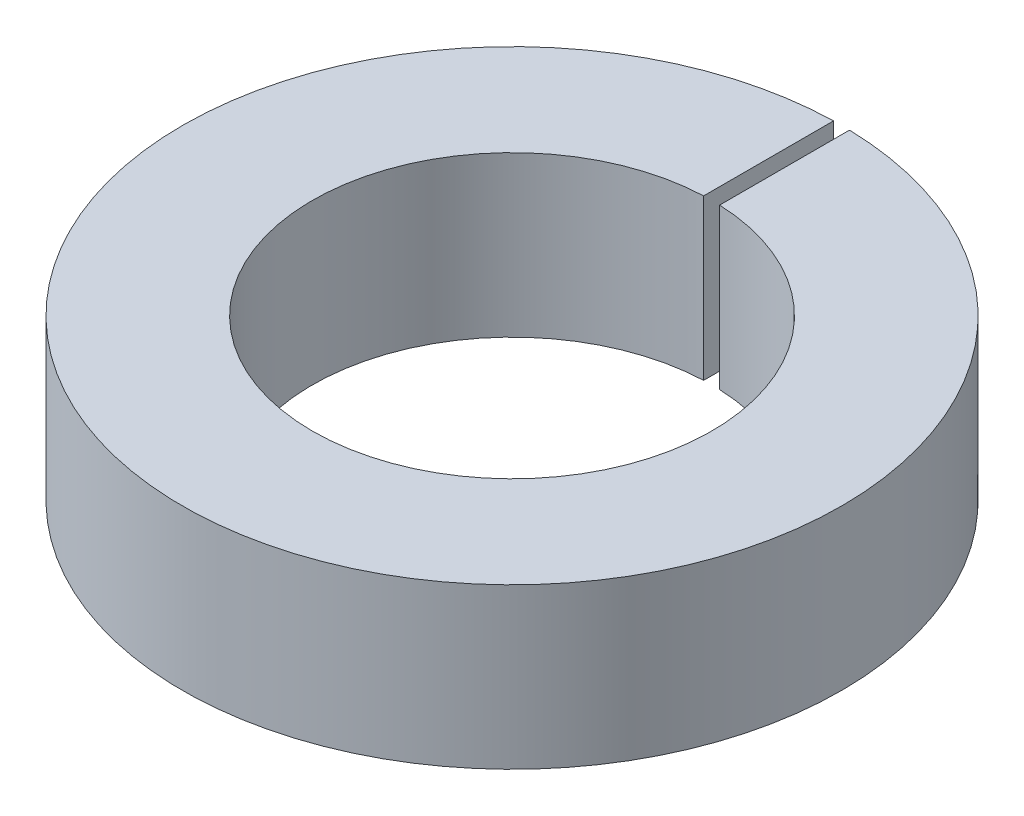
ISO-10303-21;
HEADER;
FILE_DESCRIPTION(('STEP AP214'),'2;1');
FILE_NAME('part.step','',(''),(''),'','','');
FILE_SCHEMA(('AUTOMOTIVE_DESIGN { 1 0 10303 214 1 1 1 1 }'));
ENDSEC;
DATA;
#1=APPLICATION_CONTEXT('core data for automotive mechanical design processes');
#2=APPLICATION_PROTOCOL_DEFINITION('international standard','automotive_design',2000,#1);
#3=PRODUCT_CONTEXT('',#1,'mechanical');
#4=PRODUCT('Part','Part','',(#3));
#5=PRODUCT_RELATED_PRODUCT_CATEGORY('part','',(#4));
#6=PRODUCT_DEFINITION_FORMATION('','',#4);
#7=PRODUCT_DEFINITION_CONTEXT('part definition',#1,'design');
#8=PRODUCT_DEFINITION('design','',#6,#7);
#9=PRODUCT_DEFINITION_SHAPE('','',#8);
#10=(LENGTH_UNIT() NAMED_UNIT(*) SI_UNIT(.MILLI.,.METRE.));
#11=(NAMED_UNIT(*) PLANE_ANGLE_UNIT() SI_UNIT($,.RADIAN.));
#12=(NAMED_UNIT(*) SI_UNIT($,.STERADIAN.) SOLID_ANGLE_UNIT());
#13=UNCERTAINTY_MEASURE_WITH_UNIT(LENGTH_MEASURE(1.E-05),#10,'distance_accuracy_value','');
#14=(GEOMETRIC_REPRESENTATION_CONTEXT(3) GLOBAL_UNCERTAINTY_ASSIGNED_CONTEXT((#13)) GLOBAL_UNIT_ASSIGNED_CONTEXT((#10,
#11,#12)) REPRESENTATION_CONTEXT('',''));
#15=CARTESIAN_POINT('',(0.,0.,0.));
#16=DIRECTION('',(0.,0.,1.));
#17=DIRECTION('',(1.,0.,0.));
#18=AXIS2_PLACEMENT_3D('',#15,#16,#17);
#19=CARTESIAN_POINT('',(0.,12.7,0.));
#20=DIRECTION('',(0.,1.,0.));
#21=DIRECTION('',(0.,0.,1.));
#22=AXIS2_PLACEMENT_3D('',#19,#20,#21);
#23=PLANE('',#22);
#24=DIRECTION('',(0.,0.,1.));
#25=VECTOR('',#24,1.);
#26=CARTESIAN_POINT('',(-0.635,12.7,-35.56));
#27=LINE('',#26,#25);
#28=CARTESIAN_POINT('',(-0.635,12.7,-26.1860518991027));
#29=VERTEX_POINT('',#28);
#30=CARTESIAN_POINT('',(-0.635,12.7,-15.8622949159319));
#31=VERTEX_POINT('',#30);
#32=EDGE_CURVE('E52',#29,#31,#27,.T.);
#33=ORIENTED_EDGE('',*,*,#32,.F.);
#34=CARTESIAN_POINT('',(0.,12.7,0.));
#35=DIRECTION('',(0.,1.,0.));
#36=DIRECTION('',(0.,0.,1.));
#37=AXIS2_PLACEMENT_3D('',#34,#35,#36);
#38=CIRCLE('',#37,26.19375);
#39=CARTESIAN_POINT('',(0.635,12.7,-26.1860518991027));
#40=VERTEX_POINT('',#39);
#41=EDGE_CURVE('E83',#29,#40,#38,.T.);
#42=ORIENTED_EDGE('',*,*,#41,.T.);
#43=DIRECTION('',(0.,0.,-1.));
#44=VECTOR('',#43,1.);
#45=CARTESIAN_POINT('',(0.635,12.7,-35.56));
#46=LINE('',#45,#44);
#47=CARTESIAN_POINT('',(0.635,12.7,-15.8622949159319));
#48=VERTEX_POINT('',#47);
#49=EDGE_CURVE('E86',#48,#40,#46,.T.);
#50=ORIENTED_EDGE('',*,*,#49,.F.);
#51=CARTESIAN_POINT('',(0.,12.7,0.));
#52=DIRECTION('',(0.,1.,0.));
#53=DIRECTION('',(0.,0.,1.));
#54=AXIS2_PLACEMENT_3D('',#51,#52,#53);
#55=CIRCLE('',#54,15.875);
#56=EDGE_CURVE('E85',#31,#48,#55,.T.);
#57=ORIENTED_EDGE('',*,*,#56,.F.);
#58=EDGE_LOOP('',(#33,#42,#50,#57));
#59=FACE_BOUND('',#58,.T.);
#60=ADVANCED_FACE('F30',(#59),#23,.T.);
#61=CARTESIAN_POINT('',(0.,0.,0.));
#62=DIRECTION('',(0.,1.,0.));
#63=DIRECTION('',(0.,0.,1.));
#64=AXIS2_PLACEMENT_3D('',#61,#62,#63);
#65=PLANE('',#64);
#66=CARTESIAN_POINT('',(0.,0.,0.));
#67=DIRECTION('',(0.,1.,0.));
#68=DIRECTION('',(0.,0.,1.));
#69=AXIS2_PLACEMENT_3D('',#66,#67,#68);
#70=CIRCLE('',#69,26.19375);
#71=CARTESIAN_POINT('',(-0.635,0.,-26.1860518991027));
#72=VERTEX_POINT('',#71);
#73=CARTESIAN_POINT('',(0.635,0.,-26.1860518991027));
#74=VERTEX_POINT('',#73);
#75=EDGE_CURVE('E89',#72,#74,#70,.T.);
#76=ORIENTED_EDGE('',*,*,#75,.F.);
#77=DIRECTION('',(0.,0.,1.));
#78=VECTOR('',#77,1.);
#79=CARTESIAN_POINT('',(-0.635,0.,-35.56));
#80=LINE('',#79,#78);
#81=CARTESIAN_POINT('',(-0.635,0.,-15.8622949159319));
#82=VERTEX_POINT('',#81);
#83=EDGE_CURVE('E71',#72,#82,#80,.T.);
#84=ORIENTED_EDGE('',*,*,#83,.T.);
#85=CARTESIAN_POINT('',(0.,0.,0.));
#86=DIRECTION('',(0.,1.,0.));
#87=DIRECTION('',(0.,0.,1.));
#88=AXIS2_PLACEMENT_3D('',#85,#86,#87);
#89=CIRCLE('',#88,15.875);
#90=CARTESIAN_POINT('',(0.635,0.,-15.8622949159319));
#91=VERTEX_POINT('',#90);
#92=EDGE_CURVE('E76',#82,#91,#89,.T.);
#93=ORIENTED_EDGE('',*,*,#92,.T.);
#94=DIRECTION('',(0.,0.,-1.));
#95=VECTOR('',#94,1.);
#96=CARTESIAN_POINT('',(0.635,0.,-35.56));
#97=LINE('',#96,#95);
#98=EDGE_CURVE('E45',#91,#74,#97,.T.);
#99=ORIENTED_EDGE('',*,*,#98,.T.);
#100=EDGE_LOOP('',(#76,#84,#93,#99));
#101=FACE_BOUND('',#100,.T.);
#102=ADVANCED_FACE('F104',(#101),#65,.F.);
#103=CARTESIAN_POINT('',(0.,12.7,0.));
#104=DIRECTION('',(0.,-1.,0.));
#105=DIRECTION('',(0.,0.,-1.));
#106=AXIS2_PLACEMENT_3D('',#103,#104,#105);
#107=CYLINDRICAL_SURFACE('',#106,26.19375);
#108=ORIENTED_EDGE('',*,*,#41,.F.);
#109=DIRECTION('',(0.,-1.,0.));
#110=VECTOR('',#109,1.);
#111=CARTESIAN_POINT('',(-0.635,12.7,-26.1860518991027));
#112=LINE('',#111,#110);
#113=EDGE_CURVE('E68',#29,#72,#112,.T.);
#114=ORIENTED_EDGE('',*,*,#113,.T.);
#115=ORIENTED_EDGE('',*,*,#75,.T.);
#116=DIRECTION('',(0.,-1.,0.));
#117=VECTOR('',#116,1.);
#118=CARTESIAN_POINT('',(0.635,12.7,-26.1860518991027));
#119=LINE('',#118,#117);
#120=EDGE_CURVE('E77',#74,#40,#119,.F.);
#121=ORIENTED_EDGE('',*,*,#120,.T.);
#122=EDGE_LOOP('',(#108,#114,#115,#121));
#123=FACE_BOUND('',#122,.T.);
#124=ADVANCED_FACE('F32',(#123),#107,.T.);
#125=CARTESIAN_POINT('',(0.,12.7,0.));
#126=DIRECTION('',(0.,-1.,0.));
#127=DIRECTION('',(0.,0.,-1.));
#128=AXIS2_PLACEMENT_3D('',#125,#126,#127);
#129=CYLINDRICAL_SURFACE('',#128,15.875);
#130=DIRECTION('',(0.,-1.,0.));
#131=VECTOR('',#130,1.);
#132=CARTESIAN_POINT('',(-0.635,12.7,-15.8622949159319));
#133=LINE('',#132,#131);
#134=EDGE_CURVE('E11',#31,#82,#133,.T.);
#135=ORIENTED_EDGE('',*,*,#134,.F.);
#136=ORIENTED_EDGE('',*,*,#56,.T.);
#137=DIRECTION('',(0.,-1.,0.));
#138=VECTOR('',#137,1.);
#139=CARTESIAN_POINT('',(0.635,12.7,-15.8622949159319));
#140=LINE('',#139,#138);
#141=EDGE_CURVE('E38',#91,#48,#140,.F.);
#142=ORIENTED_EDGE('',*,*,#141,.F.);
#143=ORIENTED_EDGE('',*,*,#92,.F.);
#144=EDGE_LOOP('',(#135,#136,#142,#143));
#145=FACE_BOUND('',#144,.T.);
#146=ADVANCED_FACE('F101',(#145),#129,.F.);
#147=CARTESIAN_POINT('',(0.635,0.,-35.56));
#148=DIRECTION('',(1.,0.,0.));
#149=DIRECTION('',(0.,0.,-1.));
#150=AXIS2_PLACEMENT_3D('',#147,#148,#149);
#151=PLANE('',#150);
#152=ORIENTED_EDGE('',*,*,#98,.F.);
#153=ORIENTED_EDGE('',*,*,#141,.T.);
#154=ORIENTED_EDGE('',*,*,#49,.T.);
#155=ORIENTED_EDGE('',*,*,#120,.F.);
#156=EDGE_LOOP('',(#152,#153,#154,#155));
#157=FACE_BOUND('',#156,.T.);
#158=ADVANCED_FACE('F99',(#157),#151,.F.);
#159=CARTESIAN_POINT('',(-0.635,0.,-35.56));
#160=DIRECTION('',(-1.,0.,0.));
#161=DIRECTION('',(0.,0.,1.));
#162=AXIS2_PLACEMENT_3D('',#159,#160,#161);
#163=PLANE('',#162);
#164=ORIENTED_EDGE('',*,*,#32,.T.);
#165=ORIENTED_EDGE('',*,*,#134,.T.);
#166=ORIENTED_EDGE('',*,*,#83,.F.);
#167=ORIENTED_EDGE('',*,*,#113,.F.);
#168=EDGE_LOOP('',(#164,#165,#166,#167));
#169=FACE_BOUND('',#168,.T.);
#170=ADVANCED_FACE('F69',(#169),#163,.F.);
#171=CLOSED_SHELL('',(#60,#102,#124,#146,#158,#170));
#172=MANIFOLD_SOLID_BREP('B2',#171);
#173=ADVANCED_BREP_SHAPE_REPRESENTATION('',(#18,#172),#14);
#174=SHAPE_DEFINITION_REPRESENTATION(#9,#173);
ENDSEC;
END-ISO-10303-21;
